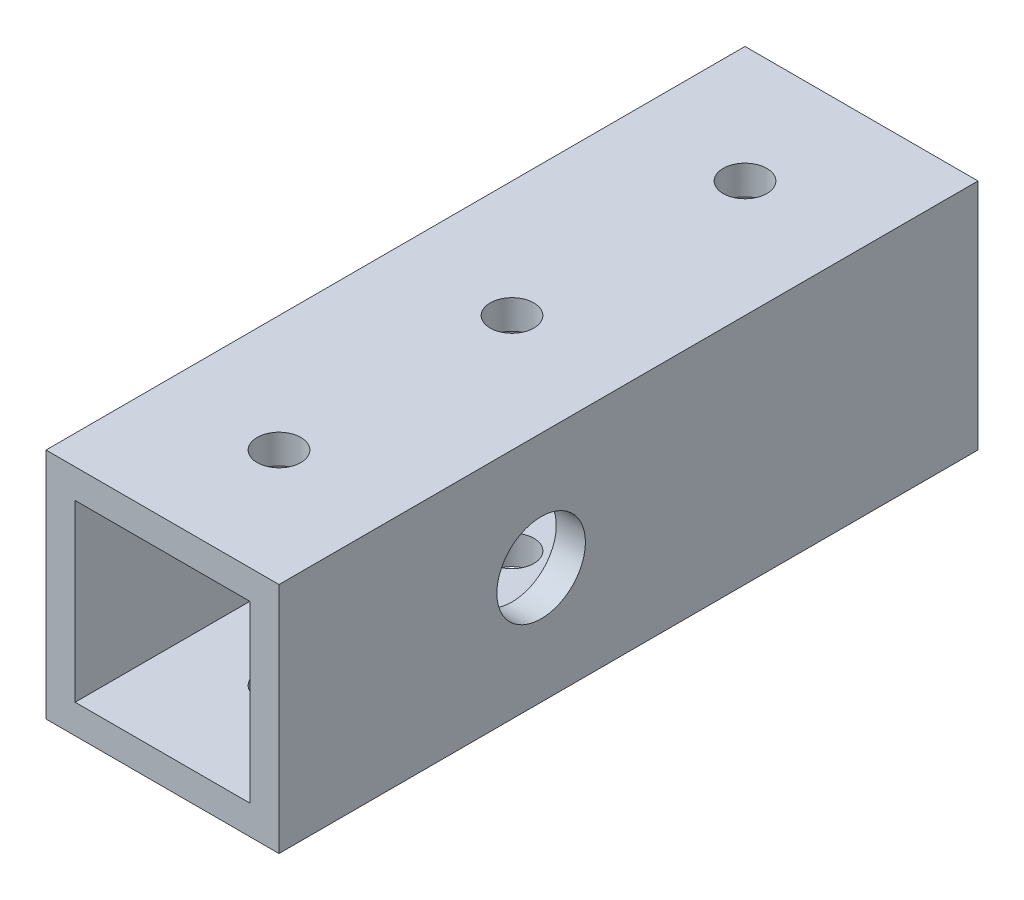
ISO-10303-21;
HEADER;
FILE_DESCRIPTION(('STEP AP214'),'2;1');
FILE_NAME('part.step','',(''),(''),'','','');
FILE_SCHEMA(('AUTOMOTIVE_DESIGN { 1 0 10303 214 1 1 1 1 }'));
ENDSEC;
DATA;
#1=APPLICATION_CONTEXT('core data for automotive mechanical design processes');
#2=APPLICATION_PROTOCOL_DEFINITION('international standard','automotive_design',2000,#1);
#3=PRODUCT_CONTEXT('',#1,'mechanical');
#4=PRODUCT('Part','Part','',(#3));
#5=PRODUCT_RELATED_PRODUCT_CATEGORY('part','',(#4));
#6=PRODUCT_DEFINITION_FORMATION('','',#4);
#7=PRODUCT_DEFINITION_CONTEXT('part definition',#1,'design');
#8=PRODUCT_DEFINITION('design','',#6,#7);
#9=PRODUCT_DEFINITION_SHAPE('','',#8);
#10=(LENGTH_UNIT() NAMED_UNIT(*) SI_UNIT(.MILLI.,.METRE.));
#11=(NAMED_UNIT(*) PLANE_ANGLE_UNIT() SI_UNIT($,.RADIAN.));
#12=(NAMED_UNIT(*) SI_UNIT($,.STERADIAN.) SOLID_ANGLE_UNIT());
#13=UNCERTAINTY_MEASURE_WITH_UNIT(LENGTH_MEASURE(1.E-05),#10,'distance_accuracy_value','');
#14=(GEOMETRIC_REPRESENTATION_CONTEXT(3) GLOBAL_UNCERTAINTY_ASSIGNED_CONTEXT((#13)) GLOBAL_UNIT_ASSIGNED_CONTEXT((#10,
#11,#12)) REPRESENTATION_CONTEXT('',''));
#15=CARTESIAN_POINT('',(0.,0.,0.));
#16=DIRECTION('',(0.,0.,1.));
#17=DIRECTION('',(1.,0.,0.));
#18=AXIS2_PLACEMENT_3D('',#15,#16,#17);
#19=CARTESIAN_POINT('',(-12.7,12.7,38.1));
#20=DIRECTION('',(0.,1.,0.));
#21=DIRECTION('',(0.,0.,1.));
#22=AXIS2_PLACEMENT_3D('',#19,#20,#21);
#23=PLANE('',#22);
#24=CARTESIAN_POINT('',(0.,12.7,0.));
#25=DIRECTION('',(0.,-1.,0.));
#26=DIRECTION('',(0.,0.,-1.));
#27=AXIS2_PLACEMENT_3D('',#24,#25,#26);
#28=CIRCLE('',#27,2.38125);
#29=CARTESIAN_POINT('',(0.,12.7,-2.38125));
#30=VERTEX_POINT('',#29);
#31=EDGE_CURVE('E323',#30,#30,#28,.T.);
#32=ORIENTED_EDGE('',*,*,#31,.T.);
#33=EDGE_LOOP('',(#32));
#34=FACE_BOUND('',#33,.T.);
#35=CARTESIAN_POINT('',(0.,12.7,25.4));
#36=DIRECTION('',(0.,-1.,0.));
#37=DIRECTION('',(0.,0.,-1.));
#38=AXIS2_PLACEMENT_3D('',#35,#36,#37);
#39=CIRCLE('',#38,2.38125);
#40=CARTESIAN_POINT('',(0.,12.7,23.01875));
#41=VERTEX_POINT('',#40);
#42=EDGE_CURVE('E201',#41,#41,#39,.T.);
#43=ORIENTED_EDGE('',*,*,#42,.T.);
#44=EDGE_LOOP('',(#43));
#45=FACE_BOUND('',#44,.T.);
#46=DIRECTION('',(1.,0.,0.));
#47=VECTOR('',#46,1.);
#48=CARTESIAN_POINT('',(-12.7,12.7,-38.1));
#49=LINE('',#48,#47);
#50=CARTESIAN_POINT('',(-12.7,12.7,-38.1));
#51=VERTEX_POINT('',#50);
#52=CARTESIAN_POINT('',(12.7,12.7,-38.1));
#53=VERTEX_POINT('',#52);
#54=EDGE_CURVE('E161',#51,#53,#49,.T.);
#55=ORIENTED_EDGE('',*,*,#54,.F.);
#56=DIRECTION('',(0.,0.,-1.));
#57=VECTOR('',#56,1.);
#58=CARTESIAN_POINT('',(-12.7,12.7,38.1));
#59=LINE('',#58,#57);
#60=CARTESIAN_POINT('',(-12.7,12.7,38.1));
#61=VERTEX_POINT('',#60);
#62=EDGE_CURVE('E186',#61,#51,#59,.T.);
#63=ORIENTED_EDGE('',*,*,#62,.F.);
#64=DIRECTION('',(1.,0.,0.));
#65=VECTOR('',#64,1.);
#66=CARTESIAN_POINT('',(-12.7,12.7,38.1));
#67=LINE('',#66,#65);
#68=CARTESIAN_POINT('',(12.7,12.7,38.1));
#69=VERTEX_POINT('',#68);
#70=EDGE_CURVE('E165',#61,#69,#67,.T.);
#71=ORIENTED_EDGE('',*,*,#70,.T.);
#72=DIRECTION('',(0.,0.,-1.));
#73=VECTOR('',#72,1.);
#74=CARTESIAN_POINT('',(12.7,12.7,38.1));
#75=LINE('',#74,#73);
#76=EDGE_CURVE('E176',#69,#53,#75,.T.);
#77=ORIENTED_EDGE('',*,*,#76,.T.);
#78=EDGE_LOOP('',(#55,#63,#71,#77));
#79=FACE_BOUND('',#78,.T.);
#80=CARTESIAN_POINT('',(0.,12.7,-25.4));
#81=DIRECTION('',(0.,-1.,0.));
#82=DIRECTION('',(0.,0.,-1.));
#83=AXIS2_PLACEMENT_3D('',#80,#81,#82);
#84=CIRCLE('',#83,2.38125);
#85=CARTESIAN_POINT('',(0.,12.7,-27.78125));
#86=VERTEX_POINT('',#85);
#87=EDGE_CURVE('E188',#86,#86,#84,.T.);
#88=ORIENTED_EDGE('',*,*,#87,.T.);
#89=EDGE_LOOP('',(#88));
#90=FACE_BOUND('',#89,.T.);
#91=ADVANCED_FACE('F59',(#34,#45,#79,#90),#23,.T.);
#92=CARTESIAN_POINT('',(-12.7,12.7,38.1));
#93=DIRECTION('',(1.,0.,0.));
#94=DIRECTION('',(0.,1.,0.));
#95=AXIS2_PLACEMENT_3D('',#92,#93,#94);
#96=PLANE('',#95);
#97=CARTESIAN_POINT('',(-12.7,0.,9.525));
#98=DIRECTION('',(1.,0.,0.));
#99=DIRECTION('',(0.,1.,0.));
#100=AXIS2_PLACEMENT_3D('',#97,#98,#99);
#101=CIRCLE('',#100,3.556);
#102=CARTESIAN_POINT('',(-12.7,3.556,9.525));
#103=VERTEX_POINT('',#102);
#104=EDGE_CURVE('E329',#103,#103,#101,.F.);
#105=ORIENTED_EDGE('',*,*,#104,.F.);
#106=EDGE_LOOP('',(#105));
#107=FACE_BOUND('',#106,.T.);
#108=DIRECTION('',(0.,-1.,0.));
#109=VECTOR('',#108,1.);
#110=CARTESIAN_POINT('',(-12.7,12.7,-38.1));
#111=LINE('',#110,#109);
#112=CARTESIAN_POINT('',(-12.7,-12.7,-38.1));
#113=VERTEX_POINT('',#112);
#114=EDGE_CURVE('E169',#51,#113,#111,.T.);
#115=ORIENTED_EDGE('',*,*,#114,.T.);
#116=DIRECTION('',(0.,0.,-1.));
#117=VECTOR('',#116,1.);
#118=CARTESIAN_POINT('',(-12.7,-12.7,38.1));
#119=LINE('',#118,#117);
#120=CARTESIAN_POINT('',(-12.7,-12.7,38.1));
#121=VERTEX_POINT('',#120);
#122=EDGE_CURVE('E189',#121,#113,#119,.T.);
#123=ORIENTED_EDGE('',*,*,#122,.F.);
#124=DIRECTION('',(0.,-1.,0.));
#125=VECTOR('',#124,1.);
#126=CARTESIAN_POINT('',(-12.7,12.7,38.1));
#127=LINE('',#126,#125);
#128=EDGE_CURVE('E174',#61,#121,#127,.T.);
#129=ORIENTED_EDGE('',*,*,#128,.F.);
#130=ORIENTED_EDGE('',*,*,#62,.T.);
#131=EDGE_LOOP('',(#115,#123,#129,#130));
#132=FACE_BOUND('',#131,.T.);
#133=ADVANCED_FACE('F229',(#107,#132),#96,.F.);
#134=CARTESIAN_POINT('',(-12.7,-12.7,38.1));
#135=DIRECTION('',(0.,1.,0.));
#136=DIRECTION('',(0.,0.,1.));
#137=AXIS2_PLACEMENT_3D('',#134,#135,#136);
#138=PLANE('',#137);
#139=CARTESIAN_POINT('',(0.,-12.7,0.));
#140=DIRECTION('',(0.,-1.,0.));
#141=DIRECTION('',(0.,0.,-1.));
#142=AXIS2_PLACEMENT_3D('',#139,#140,#141);
#143=CIRCLE('',#142,2.38125);
#144=CARTESIAN_POINT('',(0.,-12.7,-2.38125));
#145=VERTEX_POINT('',#144);
#146=EDGE_CURVE('E282',#145,#145,#143,.T.);
#147=ORIENTED_EDGE('',*,*,#146,.F.);
#148=EDGE_LOOP('',(#147));
#149=FACE_BOUND('',#148,.T.);
#150=CARTESIAN_POINT('',(0.,-12.7,25.4));
#151=DIRECTION('',(0.,-1.,0.));
#152=DIRECTION('',(0.,0.,-1.));
#153=AXIS2_PLACEMENT_3D('',#150,#151,#152);
#154=CIRCLE('',#153,2.38125);
#155=CARTESIAN_POINT('',(0.,-12.7,23.01875));
#156=VERTEX_POINT('',#155);
#157=EDGE_CURVE('E286',#156,#156,#154,.T.);
#158=ORIENTED_EDGE('',*,*,#157,.F.);
#159=EDGE_LOOP('',(#158));
#160=FACE_BOUND('',#159,.T.);
#161=DIRECTION('',(1.,0.,0.));
#162=VECTOR('',#161,1.);
#163=CARTESIAN_POINT('',(-12.7,-12.7,-38.1));
#164=LINE('',#163,#162);
#165=CARTESIAN_POINT('',(12.7,-12.7,-38.1));
#166=VERTEX_POINT('',#165);
#167=EDGE_CURVE('E182',#113,#166,#164,.T.);
#168=ORIENTED_EDGE('',*,*,#167,.T.);
#169=DIRECTION('',(0.,0.,-1.));
#170=VECTOR('',#169,1.);
#171=CARTESIAN_POINT('',(12.7,-12.7,38.1));
#172=LINE('',#171,#170);
#173=CARTESIAN_POINT('',(12.7,-12.7,38.1));
#174=VERTEX_POINT('',#173);
#175=EDGE_CURVE('E192',#174,#166,#172,.T.);
#176=ORIENTED_EDGE('',*,*,#175,.F.);
#177=DIRECTION('',(1.,0.,0.));
#178=VECTOR('',#177,1.);
#179=CARTESIAN_POINT('',(-12.7,-12.7,38.1));
#180=LINE('',#179,#178);
#181=EDGE_CURVE('E172',#121,#174,#180,.T.);
#182=ORIENTED_EDGE('',*,*,#181,.F.);
#183=ORIENTED_EDGE('',*,*,#122,.T.);
#184=EDGE_LOOP('',(#168,#176,#182,#183));
#185=FACE_BOUND('',#184,.T.);
#186=CARTESIAN_POINT('',(0.,-12.7,-25.4));
#187=DIRECTION('',(0.,-1.,0.));
#188=DIRECTION('',(0.,0.,-1.));
#189=AXIS2_PLACEMENT_3D('',#186,#187,#188);
#190=CIRCLE('',#189,2.38125);
#191=CARTESIAN_POINT('',(0.,-12.7,-27.78125));
#192=VERTEX_POINT('',#191);
#193=EDGE_CURVE('E12',#192,#192,#190,.T.);
#194=ORIENTED_EDGE('',*,*,#193,.F.);
#195=EDGE_LOOP('',(#194));
#196=FACE_BOUND('',#195,.T.);
#197=ADVANCED_FACE('F235',(#149,#160,#185,#196),#138,.F.);
#198=CARTESIAN_POINT('',(12.7,12.7,38.1));
#199=DIRECTION('',(1.,0.,0.));
#200=DIRECTION('',(0.,1.,0.));
#201=AXIS2_PLACEMENT_3D('',#198,#199,#200);
#202=PLANE('',#201);
#203=CARTESIAN_POINT('',(12.7,0.,9.525));
#204=DIRECTION('',(1.,0.,0.));
#205=DIRECTION('',(0.,1.,0.));
#206=AXIS2_PLACEMENT_3D('',#203,#204,#205);
#207=CIRCLE('',#206,4.826);
#208=CARTESIAN_POINT('',(12.7,4.826,9.525));
#209=VERTEX_POINT('',#208);
#210=EDGE_CURVE('E148',#209,#209,#207,.T.);
#211=ORIENTED_EDGE('',*,*,#210,.F.);
#212=EDGE_LOOP('',(#211));
#213=FACE_BOUND('',#212,.T.);
#214=DIRECTION('',(0.,-1.,0.));
#215=VECTOR('',#214,1.);
#216=CARTESIAN_POINT('',(12.7,12.7,-38.1));
#217=LINE('',#216,#215);
#218=EDGE_CURVE('E179',#53,#166,#217,.T.);
#219=ORIENTED_EDGE('',*,*,#218,.F.);
#220=ORIENTED_EDGE('',*,*,#76,.F.);
#221=DIRECTION('',(0.,-1.,0.));
#222=VECTOR('',#221,1.);
#223=CARTESIAN_POINT('',(12.7,12.7,38.1));
#224=LINE('',#223,#222);
#225=EDGE_CURVE('E168',#69,#174,#224,.T.);
#226=ORIENTED_EDGE('',*,*,#225,.T.);
#227=ORIENTED_EDGE('',*,*,#175,.T.);
#228=EDGE_LOOP('',(#219,#220,#226,#227));
#229=FACE_BOUND('',#228,.T.);
#230=ADVANCED_FACE('F241',(#213,#229),#202,.T.);
#231=CARTESIAN_POINT('',(0.,0.,38.1));
#232=DIRECTION('',(0.,0.,-1.));
#233=DIRECTION('',(-1.,0.,0.));
#234=AXIS2_PLACEMENT_3D('',#231,#232,#233);
#235=PLANE('',#234);
#236=DIRECTION('',(0.,-1.,0.));
#237=VECTOR('',#236,1.);
#238=CARTESIAN_POINT('',(-9.52499999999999,9.525,38.1));
#239=LINE('',#238,#237);
#240=CARTESIAN_POINT('',(-9.52499999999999,9.525,38.1));
#241=VERTEX_POINT('',#240);
#242=CARTESIAN_POINT('',(-9.52499999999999,-9.525,38.1));
#243=VERTEX_POINT('',#242);
#244=EDGE_CURVE('E131',#241,#243,#239,.T.);
#245=ORIENTED_EDGE('',*,*,#244,.F.);
#246=DIRECTION('',(1.,0.,0.));
#247=VECTOR('',#246,1.);
#248=CARTESIAN_POINT('',(-9.52499999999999,9.525,38.1));
#249=LINE('',#248,#247);
#250=CARTESIAN_POINT('',(9.52499999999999,9.525,38.1));
#251=VERTEX_POINT('',#250);
#252=EDGE_CURVE('E128',#241,#251,#249,.T.);
#253=ORIENTED_EDGE('',*,*,#252,.T.);
#254=DIRECTION('',(0.,-1.,0.));
#255=VECTOR('',#254,1.);
#256=CARTESIAN_POINT('',(9.52499999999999,9.525,38.1));
#257=LINE('',#256,#255);
#258=CARTESIAN_POINT('',(9.52499999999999,-9.525,38.1));
#259=VERTEX_POINT('',#258);
#260=EDGE_CURVE('E134',#251,#259,#257,.T.);
#261=ORIENTED_EDGE('',*,*,#260,.T.);
#262=DIRECTION('',(1.,0.,0.));
#263=VECTOR('',#262,1.);
#264=CARTESIAN_POINT('',(-9.52499999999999,-9.525,38.1));
#265=LINE('',#264,#263);
#266=EDGE_CURVE('E138',#243,#259,#265,.T.);
#267=ORIENTED_EDGE('',*,*,#266,.F.);
#268=EDGE_LOOP('',(#245,#253,#261,#267));
#269=FACE_BOUND('',#268,.T.);
#270=ORIENTED_EDGE('',*,*,#70,.F.);
#271=ORIENTED_EDGE('',*,*,#128,.T.);
#272=ORIENTED_EDGE('',*,*,#181,.T.);
#273=ORIENTED_EDGE('',*,*,#225,.F.);
#274=EDGE_LOOP('',(#270,#271,#272,#273));
#275=FACE_BOUND('',#274,.T.);
#276=ADVANCED_FACE('F140',(#269,#275),#235,.F.);
#277=CARTESIAN_POINT('',(0.,0.,-38.1));
#278=DIRECTION('',(0.,0.,-1.));
#279=DIRECTION('',(-1.,0.,0.));
#280=AXIS2_PLACEMENT_3D('',#277,#278,#279);
#281=PLANE('',#280);
#282=DIRECTION('',(1.,0.,0.));
#283=VECTOR('',#282,1.);
#284=CARTESIAN_POINT('',(-9.52499999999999,9.525,-38.1));
#285=LINE('',#284,#283);
#286=CARTESIAN_POINT('',(-9.52499999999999,9.525,-38.1));
#287=VERTEX_POINT('',#286);
#288=CARTESIAN_POINT('',(9.52499999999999,9.525,-38.1));
#289=VERTEX_POINT('',#288);
#290=EDGE_CURVE('E83',#287,#289,#285,.T.);
#291=ORIENTED_EDGE('',*,*,#290,.F.);
#292=DIRECTION('',(0.,-1.,0.));
#293=VECTOR('',#292,1.);
#294=CARTESIAN_POINT('',(-9.52499999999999,9.525,-38.1));
#295=LINE('',#294,#293);
#296=CARTESIAN_POINT('',(-9.52499999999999,-9.525,-38.1));
#297=VERTEX_POINT('',#296);
#298=EDGE_CURVE('E142',#287,#297,#295,.T.);
#299=ORIENTED_EDGE('',*,*,#298,.T.);
#300=DIRECTION('',(1.,0.,0.));
#301=VECTOR('',#300,1.);
#302=CARTESIAN_POINT('',(-9.52499999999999,-9.525,-38.1));
#303=LINE('',#302,#301);
#304=CARTESIAN_POINT('',(9.52499999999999,-9.525,-38.1));
#305=VERTEX_POINT('',#304);
#306=EDGE_CURVE('E145',#297,#305,#303,.T.);
#307=ORIENTED_EDGE('',*,*,#306,.T.);
#308=DIRECTION('',(0.,-1.,0.));
#309=VECTOR('',#308,1.);
#310=CARTESIAN_POINT('',(9.52499999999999,9.525,-38.1));
#311=LINE('',#310,#309);
#312=EDGE_CURVE('E154',#289,#305,#311,.T.);
#313=ORIENTED_EDGE('',*,*,#312,.F.);
#314=EDGE_LOOP('',(#291,#299,#307,#313));
#315=FACE_BOUND('',#314,.T.);
#316=ORIENTED_EDGE('',*,*,#54,.T.);
#317=ORIENTED_EDGE('',*,*,#218,.T.);
#318=ORIENTED_EDGE('',*,*,#167,.F.);
#319=ORIENTED_EDGE('',*,*,#114,.F.);
#320=EDGE_LOOP('',(#316,#317,#318,#319));
#321=FACE_BOUND('',#320,.T.);
#322=ADVANCED_FACE('F261',(#315,#321),#281,.T.);
#323=CARTESIAN_POINT('',(-9.52499999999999,9.525,38.1));
#324=DIRECTION('',(0.,1.,0.));
#325=DIRECTION('',(0.,0.,1.));
#326=AXIS2_PLACEMENT_3D('',#323,#324,#325);
#327=PLANE('',#326);
#328=CARTESIAN_POINT('',(0.,9.525,0.));
#329=DIRECTION('',(0.,1.,0.));
#330=DIRECTION('',(0.,0.,1.));
#331=AXIS2_PLACEMENT_3D('',#328,#329,#330);
#332=CIRCLE('',#331,2.38125);
#333=CARTESIAN_POINT('',(0.,9.525,2.38125));
#334=VERTEX_POINT('',#333);
#335=EDGE_CURVE('E319',#334,#334,#332,.T.);
#336=ORIENTED_EDGE('',*,*,#335,.T.);
#337=EDGE_LOOP('',(#336));
#338=FACE_BOUND('',#337,.T.);
#339=CARTESIAN_POINT('',(0.,9.525,25.4));
#340=DIRECTION('',(0.,1.,0.));
#341=DIRECTION('',(0.,0.,1.));
#342=AXIS2_PLACEMENT_3D('',#339,#340,#341);
#343=CIRCLE('',#342,2.38125);
#344=CARTESIAN_POINT('',(0.,9.525,27.78125));
#345=VERTEX_POINT('',#344);
#346=EDGE_CURVE('E200',#345,#345,#343,.T.);
#347=ORIENTED_EDGE('',*,*,#346,.T.);
#348=EDGE_LOOP('',(#347));
#349=FACE_BOUND('',#348,.T.);
#350=ORIENTED_EDGE('',*,*,#290,.T.);
#351=DIRECTION('',(0.,0.,-1.));
#352=VECTOR('',#351,1.);
#353=CARTESIAN_POINT('',(9.52499999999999,9.525,38.1));
#354=LINE('',#353,#352);
#355=EDGE_CURVE('E124',#251,#289,#354,.T.);
#356=ORIENTED_EDGE('',*,*,#355,.F.);
#357=ORIENTED_EDGE('',*,*,#252,.F.);
#358=DIRECTION('',(0.,0.,-1.));
#359=VECTOR('',#358,1.);
#360=CARTESIAN_POINT('',(-9.52499999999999,9.525,38.1));
#361=LINE('',#360,#359);
#362=EDGE_CURVE('E159',#241,#287,#361,.T.);
#363=ORIENTED_EDGE('',*,*,#362,.T.);
#364=EDGE_LOOP('',(#350,#356,#357,#363));
#365=FACE_BOUND('',#364,.T.);
#366=CARTESIAN_POINT('',(0.,9.525,-25.4));
#367=DIRECTION('',(0.,1.,0.));
#368=DIRECTION('',(0.,0.,1.));
#369=AXIS2_PLACEMENT_3D('',#366,#367,#368);
#370=CIRCLE('',#369,2.38125);
#371=CARTESIAN_POINT('',(0.,9.525,-23.01875));
#372=VERTEX_POINT('',#371);
#373=EDGE_CURVE('E204',#372,#372,#370,.T.);
#374=ORIENTED_EDGE('',*,*,#373,.T.);
#375=EDGE_LOOP('',(#374));
#376=FACE_BOUND('',#375,.T.);
#377=ADVANCED_FACE('F125',(#338,#349,#365,#376),#327,.F.);
#378=CARTESIAN_POINT('',(-9.52499999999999,9.525,38.1));
#379=DIRECTION('',(1.,0.,0.));
#380=DIRECTION('',(0.,1.,0.));
#381=AXIS2_PLACEMENT_3D('',#378,#379,#380);
#382=PLANE('',#381);
#383=CARTESIAN_POINT('',(-9.52499999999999,0.,9.525));
#384=DIRECTION('',(1.,0.,0.));
#385=DIRECTION('',(0.,1.,0.));
#386=AXIS2_PLACEMENT_3D('',#383,#384,#385);
#387=CIRCLE('',#386,3.556);
#388=CARTESIAN_POINT('',(-9.52499999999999,3.556,9.525));
#389=VERTEX_POINT('',#388);
#390=EDGE_CURVE('E63',#389,#389,#387,.F.);
#391=ORIENTED_EDGE('',*,*,#390,.T.);
#392=EDGE_LOOP('',(#391));
#393=FACE_BOUND('',#392,.T.);
#394=ORIENTED_EDGE('',*,*,#298,.F.);
#395=ORIENTED_EDGE('',*,*,#362,.F.);
#396=ORIENTED_EDGE('',*,*,#244,.T.);
#397=DIRECTION('',(0.,0.,-1.));
#398=VECTOR('',#397,1.);
#399=CARTESIAN_POINT('',(-9.52499999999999,-9.525,38.1));
#400=LINE('',#399,#398);
#401=EDGE_CURVE('E162',#243,#297,#400,.T.);
#402=ORIENTED_EDGE('',*,*,#401,.T.);
#403=EDGE_LOOP('',(#394,#395,#396,#402));
#404=FACE_BOUND('',#403,.T.);
#405=ADVANCED_FACE('F214',(#393,#404),#382,.T.);
#406=CARTESIAN_POINT('',(-9.52499999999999,-9.525,38.1));
#407=DIRECTION('',(0.,1.,0.));
#408=DIRECTION('',(0.,0.,1.));
#409=AXIS2_PLACEMENT_3D('',#406,#407,#408);
#410=PLANE('',#409);
#411=CARTESIAN_POINT('',(0.,-9.525,0.));
#412=DIRECTION('',(0.,1.,0.));
#413=DIRECTION('',(0.,0.,1.));
#414=AXIS2_PLACEMENT_3D('',#411,#412,#413);
#415=CIRCLE('',#414,2.38125);
#416=CARTESIAN_POINT('',(0.,-9.525,2.38125));
#417=VERTEX_POINT('',#416);
#418=EDGE_CURVE('E326',#417,#417,#415,.T.);
#419=ORIENTED_EDGE('',*,*,#418,.F.);
#420=EDGE_LOOP('',(#419));
#421=FACE_BOUND('',#420,.T.);
#422=CARTESIAN_POINT('',(0.,-9.525,25.4));
#423=DIRECTION('',(0.,1.,0.));
#424=DIRECTION('',(0.,0.,1.));
#425=AXIS2_PLACEMENT_3D('',#422,#423,#424);
#426=CIRCLE('',#425,2.38125);
#427=CARTESIAN_POINT('',(0.,-9.525,27.78125));
#428=VERTEX_POINT('',#427);
#429=EDGE_CURVE('E197',#428,#428,#426,.T.);
#430=ORIENTED_EDGE('',*,*,#429,.F.);
#431=EDGE_LOOP('',(#430));
#432=FACE_BOUND('',#431,.T.);
#433=ORIENTED_EDGE('',*,*,#306,.F.);
#434=ORIENTED_EDGE('',*,*,#401,.F.);
#435=ORIENTED_EDGE('',*,*,#266,.T.);
#436=DIRECTION('',(0.,0.,-1.));
#437=VECTOR('',#436,1.);
#438=CARTESIAN_POINT('',(9.52499999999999,-9.525,38.1));
#439=LINE('',#438,#437);
#440=EDGE_CURVE('E75',#259,#305,#439,.T.);
#441=ORIENTED_EDGE('',*,*,#440,.T.);
#442=EDGE_LOOP('',(#433,#434,#435,#441));
#443=FACE_BOUND('',#442,.T.);
#444=CARTESIAN_POINT('',(0.,-9.525,-25.4));
#445=DIRECTION('',(0.,1.,0.));
#446=DIRECTION('',(0.,0.,1.));
#447=AXIS2_PLACEMENT_3D('',#444,#445,#446);
#448=CIRCLE('',#447,2.38125);
#449=CARTESIAN_POINT('',(0.,-9.525,-23.01875));
#450=VERTEX_POINT('',#449);
#451=EDGE_CURVE('E68',#450,#450,#448,.T.);
#452=ORIENTED_EDGE('',*,*,#451,.F.);
#453=EDGE_LOOP('',(#452));
#454=FACE_BOUND('',#453,.T.);
#455=ADVANCED_FACE('F212',(#421,#432,#443,#454),#410,.T.);
#456=CARTESIAN_POINT('',(9.52499999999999,9.525,38.1));
#457=DIRECTION('',(1.,0.,0.));
#458=DIRECTION('',(0.,1.,0.));
#459=AXIS2_PLACEMENT_3D('',#456,#457,#458);
#460=PLANE('',#459);
#461=CARTESIAN_POINT('',(9.52499999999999,0.,9.525));
#462=DIRECTION('',(1.,0.,0.));
#463=DIRECTION('',(0.,1.,0.));
#464=AXIS2_PLACEMENT_3D('',#461,#462,#463);
#465=CIRCLE('',#464,4.826);
#466=CARTESIAN_POINT('',(9.52499999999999,4.826,9.525));
#467=VERTEX_POINT('',#466);
#468=EDGE_CURVE('E155',#467,#467,#465,.T.);
#469=ORIENTED_EDGE('',*,*,#468,.T.);
#470=EDGE_LOOP('',(#469));
#471=FACE_BOUND('',#470,.T.);
#472=ORIENTED_EDGE('',*,*,#312,.T.);
#473=ORIENTED_EDGE('',*,*,#440,.F.);
#474=ORIENTED_EDGE('',*,*,#260,.F.);
#475=ORIENTED_EDGE('',*,*,#355,.T.);
#476=EDGE_LOOP('',(#472,#473,#474,#475));
#477=FACE_BOUND('',#476,.T.);
#478=ADVANCED_FACE('F135',(#471,#477),#460,.F.);
#479=CARTESIAN_POINT('',(1.27000000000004,0.,9.525));
#480=DIRECTION('',(1.,0.,0.));
#481=DIRECTION('',(0.,1.,0.));
#482=AXIS2_PLACEMENT_3D('',#479,#480,#481);
#483=CYLINDRICAL_SURFACE('',#482,4.826);
#484=CARTESIAN_POINT('',(12.7,4.826,9.525));
#485=CARTESIAN_POINT('',(12.6669270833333,4.826,9.525));
#486=CARTESIAN_POINT('',(12.6338541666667,4.826,9.525));
#487=CARTESIAN_POINT('',(12.5677083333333,4.826,9.525));
#488=CARTESIAN_POINT('',(12.5346354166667,4.826,9.525));
#489=CARTESIAN_POINT('',(12.4684895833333,4.826,9.525));
#490=CARTESIAN_POINT('',(12.4354166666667,4.826,9.525));
#491=CARTESIAN_POINT('',(12.3692708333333,4.826,9.525));
#492=CARTESIAN_POINT('',(12.3361979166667,4.826,9.525));
#493=CARTESIAN_POINT('',(12.2700520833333,4.826,9.525));
#494=CARTESIAN_POINT('',(12.2369791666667,4.826,9.525));
#495=CARTESIAN_POINT('',(12.1708333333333,4.826,9.525));
#496=CARTESIAN_POINT('',(12.1377604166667,4.826,9.525));
#497=CARTESIAN_POINT('',(12.0716145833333,4.826,9.525));
#498=CARTESIAN_POINT('',(12.0385416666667,4.826,9.525));
#499=CARTESIAN_POINT('',(11.9723958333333,4.826,9.525));
#500=CARTESIAN_POINT('',(11.9393229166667,4.826,9.525));
#501=CARTESIAN_POINT('',(11.8731770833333,4.826,9.525));
#502=CARTESIAN_POINT('',(11.8401041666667,4.826,9.525));
#503=CARTESIAN_POINT('',(11.7739583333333,4.826,9.525));
#504=CARTESIAN_POINT('',(11.7408854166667,4.826,9.525));
#505=CARTESIAN_POINT('',(11.6747395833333,4.826,9.525));
#506=CARTESIAN_POINT('',(11.6416666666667,4.826,9.525));
#507=CARTESIAN_POINT('',(11.5755208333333,4.826,9.525));
#508=CARTESIAN_POINT('',(11.5424479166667,4.826,9.525));
#509=CARTESIAN_POINT('',(11.4763020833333,4.826,9.525));
#510=CARTESIAN_POINT('',(11.4432291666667,4.826,9.525));
#511=CARTESIAN_POINT('',(11.3770833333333,4.826,9.525));
#512=CARTESIAN_POINT('',(11.3440104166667,4.826,9.525));
#513=CARTESIAN_POINT('',(11.2778645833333,4.826,9.525));
#514=CARTESIAN_POINT('',(11.2447916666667,4.826,9.525));
#515=CARTESIAN_POINT('',(11.1786458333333,4.826,9.525));
#516=CARTESIAN_POINT('',(11.1455729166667,4.826,9.525));
#517=CARTESIAN_POINT('',(11.0794270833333,4.826,9.525));
#518=CARTESIAN_POINT('',(11.0463541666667,4.826,9.525));
#519=CARTESIAN_POINT('',(10.9802083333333,4.826,9.525));
#520=CARTESIAN_POINT('',(10.9471354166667,4.826,9.525));
#521=CARTESIAN_POINT('',(10.8809895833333,4.826,9.525));
#522=CARTESIAN_POINT('',(10.8479166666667,4.826,9.525));
#523=CARTESIAN_POINT('',(10.7817708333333,4.826,9.525));
#524=CARTESIAN_POINT('',(10.7486979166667,4.826,9.525));
#525=CARTESIAN_POINT('',(10.6825520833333,4.826,9.525));
#526=CARTESIAN_POINT('',(10.6494791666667,4.826,9.525));
#527=CARTESIAN_POINT('',(10.5833333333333,4.826,9.525));
#528=CARTESIAN_POINT('',(10.5502604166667,4.826,9.525));
#529=CARTESIAN_POINT('',(10.4841145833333,4.826,9.525));
#530=CARTESIAN_POINT('',(10.4510416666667,4.826,9.525));
#531=CARTESIAN_POINT('',(10.3848958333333,4.826,9.525));
#532=CARTESIAN_POINT('',(10.3518229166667,4.826,9.525));
#533=CARTESIAN_POINT('',(10.2856770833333,4.826,9.525));
#534=CARTESIAN_POINT('',(10.2526041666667,4.826,9.525));
#535=CARTESIAN_POINT('',(10.1864583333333,4.826,9.525));
#536=CARTESIAN_POINT('',(10.1533854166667,4.826,9.525));
#537=CARTESIAN_POINT('',(10.0872395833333,4.826,9.525));
#538=CARTESIAN_POINT('',(10.0541666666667,4.826,9.525));
#539=CARTESIAN_POINT('',(9.98802083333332,4.826,9.525));
#540=CARTESIAN_POINT('',(9.95494791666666,4.826,9.525));
#541=CARTESIAN_POINT('',(9.88880208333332,4.826,9.525));
#542=CARTESIAN_POINT('',(9.85572916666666,4.826,9.525));
#543=CARTESIAN_POINT('',(9.78958333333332,4.826,9.525));
#544=CARTESIAN_POINT('',(9.75651041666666,4.826,9.525));
#545=CARTESIAN_POINT('',(9.69036458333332,4.826,9.525));
#546=CARTESIAN_POINT('',(9.65729166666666,4.826,9.525));
#547=CARTESIAN_POINT('',(9.59114583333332,4.826,9.525));
#548=CARTESIAN_POINT('',(9.55807291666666,4.826,9.525));
#549=CARTESIAN_POINT('',(9.52499999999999,4.826,9.525));
#550=B_SPLINE_CURVE_WITH_KNOTS('',3,(#484,#485,#486,#487,#488,#489,#490,#491,#492,#493,#494,
#495,#496,#497,#498,#499,#500,#501,#502,#503,#504,#505,#506,#507,#508,#509,#510,#511,#512,#513,
#514,#515,#516,#517,#518,#519,#520,#521,#522,#523,#524,#525,#526,#527,#528,#529,#530,#531,#532,
#533,#534,#535,#536,#537,#538,#539,#540,#541,#542,#543,#544,#545,#546,#547,#548,#549),
.UNSPECIFIED.,.F.,.F.,(4,2,2,2,2,2,2,2,2,2,2,2,2,2,2,2,2,2,2,2,2,2,2,2,2,2,2,2,2,2,2,2,4),(0.,
0.0992187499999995,0.198437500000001,0.29765625,0.396875,0.496093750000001,0.5953125,0.69453125,
0.793749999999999,0.892968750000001,0.9921875,1.09140625,1.190625,1.28984375,1.3890625,
1.48828125,1.5875,1.68671875,1.7859375,1.88515625,1.984375,2.08359375,2.1828125,2.28203125,
2.38125,2.48046875,2.5796875,2.67890625,2.778125,2.87734375,2.9765625,3.07578125,3.175),.UNSPECIFIED.);
#551=EDGE_CURVE('BSEAM221',#209,#467,#550,.T.);
#552=ORIENTED_EDGE('',*,*,#210,.T.);
#553=ORIENTED_EDGE('',*,*,#468,.F.);
#554=ORIENTED_EDGE('',*,*,#551,.T.);
#555=ORIENTED_EDGE('',*,*,#551,.F.);
#556=EDGE_LOOP('',(#552,#554,#553,#555));
#557=FACE_BOUND('',#556,.T.);
#558=ADVANCED_FACE('F221',(#557),#483,.F.);
#559=CARTESIAN_POINT('',(0.,12.7,25.4));
#560=DIRECTION('',(0.,-1.,0.));
#561=DIRECTION('',(0.,0.,-1.));
#562=AXIS2_PLACEMENT_3D('',#559,#560,#561);
#563=CYLINDRICAL_SURFACE('',#562,2.38125);
#564=ORIENTED_EDGE('',*,*,#429,.T.);
#565=EDGE_LOOP('',(#564));
#566=FACE_BOUND('',#565,.T.);
#567=ORIENTED_EDGE('',*,*,#157,.T.);
#568=EDGE_LOOP('',(#567));
#569=FACE_BOUND('',#568,.T.);
#570=ADVANCED_FACE('F303',(#566,#569),#563,.F.);
#571=ORIENTED_EDGE('',*,*,#42,.F.);
#572=EDGE_LOOP('',(#571));
#573=FACE_BOUND('',#572,.T.);
#574=ORIENTED_EDGE('',*,*,#346,.F.);
#575=EDGE_LOOP('',(#574));
#576=FACE_BOUND('',#575,.T.);
#577=ADVANCED_FACE('F254',(#573,#576),#563,.F.);
#578=CARTESIAN_POINT('',(0.,12.7,0.));
#579=DIRECTION('',(0.,-1.,0.));
#580=DIRECTION('',(0.,0.,-1.));
#581=AXIS2_PLACEMENT_3D('',#578,#579,#580);
#582=CYLINDRICAL_SURFACE('',#581,2.38125);
#583=ORIENTED_EDGE('',*,*,#31,.F.);
#584=EDGE_LOOP('',(#583));
#585=FACE_BOUND('',#584,.T.);
#586=ORIENTED_EDGE('',*,*,#335,.F.);
#587=EDGE_LOOP('',(#586));
#588=FACE_BOUND('',#587,.T.);
#589=ADVANCED_FACE('F246',(#585,#588),#582,.F.);
#590=CARTESIAN_POINT('',(0.,12.7,-25.4));
#591=DIRECTION('',(0.,-1.,0.));
#592=DIRECTION('',(0.,0.,-1.));
#593=AXIS2_PLACEMENT_3D('',#590,#591,#592);
#594=CYLINDRICAL_SURFACE('',#593,2.38125);
#595=ORIENTED_EDGE('',*,*,#87,.F.);
#596=EDGE_LOOP('',(#595));
#597=FACE_BOUND('',#596,.T.);
#598=ORIENTED_EDGE('',*,*,#373,.F.);
#599=EDGE_LOOP('',(#598));
#600=FACE_BOUND('',#599,.T.);
#601=ADVANCED_FACE('F243',(#597,#600),#594,.F.);
#602=CARTESIAN_POINT('',(0.,12.7,0.));
#603=DIRECTION('',(0.,-1.,0.));
#604=DIRECTION('',(0.,0.,-1.));
#605=AXIS2_PLACEMENT_3D('',#602,#603,#604);
#606=CYLINDRICAL_SURFACE('',#605,2.38125);
#607=ORIENTED_EDGE('',*,*,#418,.T.);
#608=EDGE_LOOP('',(#607));
#609=FACE_BOUND('',#608,.T.);
#610=ORIENTED_EDGE('',*,*,#146,.T.);
#611=EDGE_LOOP('',(#610));
#612=FACE_BOUND('',#611,.T.);
#613=ADVANCED_FACE('F245',(#609,#612),#606,.F.);
#614=CARTESIAN_POINT('',(0.,12.7,-25.4));
#615=DIRECTION('',(0.,-1.,0.));
#616=DIRECTION('',(0.,0.,-1.));
#617=AXIS2_PLACEMENT_3D('',#614,#615,#616);
#618=CYLINDRICAL_SURFACE('',#617,2.38125);
#619=ORIENTED_EDGE('',*,*,#451,.T.);
#620=EDGE_LOOP('',(#619));
#621=FACE_BOUND('',#620,.T.);
#622=ORIENTED_EDGE('',*,*,#193,.T.);
#623=EDGE_LOOP('',(#622));
#624=FACE_BOUND('',#623,.T.);
#625=ADVANCED_FACE('F61',(#621,#624),#618,.F.);
#626=CARTESIAN_POINT('',(-2.66699999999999,0.,9.525));
#627=DIRECTION('',(-1.,0.,0.));
#628=DIRECTION('',(0.,-1.,0.));
#629=AXIS2_PLACEMENT_3D('',#626,#627,#628);
#630=CYLINDRICAL_SURFACE('',#629,3.556);
#631=ORIENTED_EDGE('',*,*,#390,.F.);
#632=EDGE_LOOP('',(#631));
#633=FACE_BOUND('',#632,.T.);
#634=ORIENTED_EDGE('',*,*,#104,.T.);
#635=EDGE_LOOP('',(#634));
#636=FACE_BOUND('',#635,.T.);
#637=ADVANCED_FACE('F292',(#633,#636),#630,.F.);
#638=CLOSED_SHELL('',(#91,#133,#197,#230,#276,#322,#377,#405,#455,#478,#558,#570,#577,#589,#601,
#613,#625,#637));
#639=MANIFOLD_SOLID_BREP('B2',#638);
#640=ADVANCED_BREP_SHAPE_REPRESENTATION('',(#18,#639),#14);
#641=SHAPE_DEFINITION_REPRESENTATION(#9,#640);
ENDSEC;
END-ISO-10303-21;
